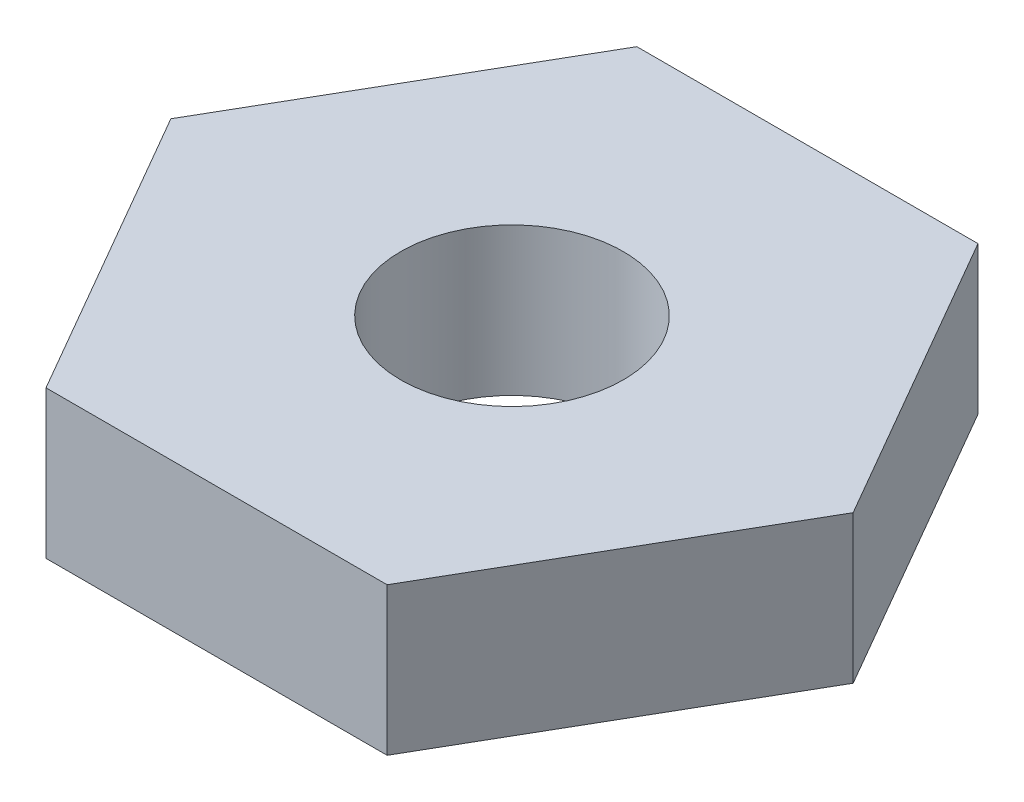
ISO-10303-21;
HEADER;
FILE_DESCRIPTION(('STEP AP214'),'2;1');
FILE_NAME('part.step','',(''),(''),'','','');
FILE_SCHEMA(('AUTOMOTIVE_DESIGN { 1 0 10303 214 1 1 1 1 }'));
ENDSEC;
DATA;
#1=APPLICATION_CONTEXT('core data for automotive mechanical design processes');
#2=APPLICATION_PROTOCOL_DEFINITION('international standard','automotive_design',2000,#1);
#3=PRODUCT_CONTEXT('',#1,'mechanical');
#4=PRODUCT('Part','Part','',(#3));
#5=PRODUCT_RELATED_PRODUCT_CATEGORY('part','',(#4));
#6=PRODUCT_DEFINITION_FORMATION('','',#4);
#7=PRODUCT_DEFINITION_CONTEXT('part definition',#1,'design');
#8=PRODUCT_DEFINITION('design','',#6,#7);
#9=PRODUCT_DEFINITION_SHAPE('','',#8);
#10=(LENGTH_UNIT() NAMED_UNIT(*) SI_UNIT(.MILLI.,.METRE.));
#11=(NAMED_UNIT(*) PLANE_ANGLE_UNIT() SI_UNIT($,.RADIAN.));
#12=(NAMED_UNIT(*) SI_UNIT($,.STERADIAN.) SOLID_ANGLE_UNIT());
#13=UNCERTAINTY_MEASURE_WITH_UNIT(LENGTH_MEASURE(1.E-05),#10,'distance_accuracy_value','');
#14=(GEOMETRIC_REPRESENTATION_CONTEXT(3) GLOBAL_UNCERTAINTY_ASSIGNED_CONTEXT((#13)) GLOBAL_UNIT_ASSIGNED_CONTEXT((#10,
#11,#12)) REPRESENTATION_CONTEXT('',''));
#15=CARTESIAN_POINT('',(0.,0.,0.));
#16=DIRECTION('',(0.,0.,1.));
#17=DIRECTION('',(1.,0.,0.));
#18=AXIS2_PLACEMENT_3D('',#15,#16,#17);
#19=CARTESIAN_POINT('',(0.,1.5,0.));
#20=DIRECTION('',(0.,1.,0.));
#21=DIRECTION('',(0.,0.,1.));
#22=AXIS2_PLACEMENT_3D('',#19,#20,#21);
#23=PLANE('',#22);
#24=DIRECTION('',(0.5,0.,-0.866025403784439));
#25=VECTOR('',#24,1.);
#26=CARTESIAN_POINT('',(1.73205080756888,1.5,3.));
#27=LINE('',#26,#25);
#28=CARTESIAN_POINT('',(1.73205080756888,1.5,3.));
#29=VERTEX_POINT('',#28);
#30=CARTESIAN_POINT('',(3.46410161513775,1.5,0.));
#31=VERTEX_POINT('',#30);
#32=EDGE_CURVE('E146',#29,#31,#27,.T.);
#33=ORIENTED_EDGE('',*,*,#32,.T.);
#34=DIRECTION('',(-0.5,0.,-0.866025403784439));
#35=VECTOR('',#34,1.);
#36=CARTESIAN_POINT('',(3.46410161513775,1.5,0.));
#37=LINE('',#36,#35);
#38=CARTESIAN_POINT('',(1.73205080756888,1.5,-3.));
#39=VERTEX_POINT('',#38);
#40=EDGE_CURVE('E94',#31,#39,#37,.T.);
#41=ORIENTED_EDGE('',*,*,#40,.T.);
#42=DIRECTION('',(-1.,0.,0.));
#43=VECTOR('',#42,1.);
#44=CARTESIAN_POINT('',(1.73205080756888,1.5,-3.));
#45=LINE('',#44,#43);
#46=CARTESIAN_POINT('',(-1.73205080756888,1.5,-3.));
#47=VERTEX_POINT('',#46);
#48=EDGE_CURVE('E107',#39,#47,#45,.T.);
#49=ORIENTED_EDGE('',*,*,#48,.T.);
#50=DIRECTION('',(-0.5,0.,0.866025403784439));
#51=VECTOR('',#50,1.);
#52=CARTESIAN_POINT('',(-1.73205080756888,1.5,-3.));
#53=LINE('',#52,#51);
#54=CARTESIAN_POINT('',(-3.46410161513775,1.5,0.));
#55=VERTEX_POINT('',#54);
#56=EDGE_CURVE('E101',#47,#55,#53,.T.);
#57=ORIENTED_EDGE('',*,*,#56,.T.);
#58=DIRECTION('',(0.5,0.,0.866025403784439));
#59=VECTOR('',#58,1.);
#60=CARTESIAN_POINT('',(-3.46410161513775,1.5,0.));
#61=LINE('',#60,#59);
#62=CARTESIAN_POINT('',(-1.73205080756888,1.5,3.));
#63=VERTEX_POINT('',#62);
#64=EDGE_CURVE('E105',#55,#63,#61,.T.);
#65=ORIENTED_EDGE('',*,*,#64,.T.);
#66=DIRECTION('',(1.,0.,0.));
#67=VECTOR('',#66,1.);
#68=CARTESIAN_POINT('',(-1.73205080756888,1.5,3.));
#69=LINE('',#68,#67);
#70=EDGE_CURVE('E57',#63,#29,#69,.T.);
#71=ORIENTED_EDGE('',*,*,#70,.T.);
#72=EDGE_LOOP('',(#33,#41,#49,#57,#65,#71));
#73=FACE_BOUND('',#72,.T.);
#74=CARTESIAN_POINT('',(0.,1.5,0.));
#75=DIRECTION('',(0.,1.,0.));
#76=DIRECTION('',(0.,0.,1.));
#77=AXIS2_PLACEMENT_3D('',#74,#75,#76);
#78=CIRCLE('',#77,1.13);
#79=CARTESIAN_POINT('',(0.,1.5,1.13));
#80=VERTEX_POINT('',#79);
#81=EDGE_CURVE('E134',#80,#80,#78,.T.);
#82=ORIENTED_EDGE('',*,*,#81,.F.);
#83=EDGE_LOOP('',(#82));
#84=FACE_BOUND('',#83,.T.);
#85=ADVANCED_FACE('F39',(#73,#84),#23,.T.);
#86=CARTESIAN_POINT('',(0.,0.,0.));
#87=DIRECTION('',(0.,1.,0.));
#88=DIRECTION('',(0.,0.,1.));
#89=AXIS2_PLACEMENT_3D('',#86,#87,#88);
#90=PLANE('',#89);
#91=DIRECTION('',(0.5,0.,-0.866025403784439));
#92=VECTOR('',#91,1.);
#93=CARTESIAN_POINT('',(1.73205080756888,0.,3.));
#94=LINE('',#93,#92);
#95=CARTESIAN_POINT('',(1.73205080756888,0.,3.));
#96=VERTEX_POINT('',#95);
#97=CARTESIAN_POINT('',(3.46410161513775,0.,0.));
#98=VERTEX_POINT('',#97);
#99=EDGE_CURVE('E129',#96,#98,#94,.T.);
#100=ORIENTED_EDGE('',*,*,#99,.F.);
#101=DIRECTION('',(1.,0.,0.));
#102=VECTOR('',#101,1.);
#103=CARTESIAN_POINT('',(-1.73205080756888,0.,3.));
#104=LINE('',#103,#102);
#105=CARTESIAN_POINT('',(-1.73205080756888,0.,3.));
#106=VERTEX_POINT('',#105);
#107=EDGE_CURVE('E86',#106,#96,#104,.T.);
#108=ORIENTED_EDGE('',*,*,#107,.F.);
#109=DIRECTION('',(0.5,0.,0.866025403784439));
#110=VECTOR('',#109,1.);
#111=CARTESIAN_POINT('',(-3.46410161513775,0.,0.));
#112=LINE('',#111,#110);
#113=CARTESIAN_POINT('',(-3.46410161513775,0.,0.));
#114=VERTEX_POINT('',#113);
#115=EDGE_CURVE('E80',#114,#106,#112,.T.);
#116=ORIENTED_EDGE('',*,*,#115,.F.);
#117=DIRECTION('',(-0.5,0.,0.866025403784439));
#118=VECTOR('',#117,1.);
#119=CARTESIAN_POINT('',(-1.73205080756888,0.,-3.));
#120=LINE('',#119,#118);
#121=CARTESIAN_POINT('',(-1.73205080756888,0.,-3.));
#122=VERTEX_POINT('',#121);
#123=EDGE_CURVE('E116',#122,#114,#120,.T.);
#124=ORIENTED_EDGE('',*,*,#123,.F.);
#125=DIRECTION('',(-1.,0.,0.));
#126=VECTOR('',#125,1.);
#127=CARTESIAN_POINT('',(1.73205080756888,0.,-3.));
#128=LINE('',#127,#126);
#129=CARTESIAN_POINT('',(1.73205080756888,0.,-3.));
#130=VERTEX_POINT('',#129);
#131=EDGE_CURVE('E137',#130,#122,#128,.T.);
#132=ORIENTED_EDGE('',*,*,#131,.F.);
#133=DIRECTION('',(-0.5,0.,-0.866025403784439));
#134=VECTOR('',#133,1.);
#135=CARTESIAN_POINT('',(3.46410161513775,0.,0.));
#136=LINE('',#135,#134);
#137=EDGE_CURVE('E133',#98,#130,#136,.T.);
#138=ORIENTED_EDGE('',*,*,#137,.F.);
#139=EDGE_LOOP('',(#100,#108,#116,#124,#132,#138));
#140=FACE_BOUND('',#139,.T.);
#141=CARTESIAN_POINT('',(0.,0.,0.));
#142=DIRECTION('',(0.,1.,0.));
#143=DIRECTION('',(0.,0.,1.));
#144=AXIS2_PLACEMENT_3D('',#141,#142,#143);
#145=CIRCLE('',#144,1.13);
#146=CARTESIAN_POINT('',(0.,0.,1.13));
#147=VERTEX_POINT('',#146);
#148=EDGE_CURVE('E243',#147,#147,#145,.T.);
#149=ORIENTED_EDGE('',*,*,#148,.T.);
#150=EDGE_LOOP('',(#149));
#151=FACE_BOUND('',#150,.T.);
#152=ADVANCED_FACE('F159',(#140,#151),#90,.F.);
#153=CARTESIAN_POINT('',(1.73205080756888,1.5,3.));
#154=DIRECTION('',(-0.866025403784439,0.,-0.5));
#155=DIRECTION('',(-0.5,0.,0.866025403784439));
#156=AXIS2_PLACEMENT_3D('',#153,#154,#155);
#157=PLANE('',#156);
#158=ORIENTED_EDGE('',*,*,#99,.T.);
#159=DIRECTION('',(0.,-1.,0.));
#160=VECTOR('',#159,1.);
#161=CARTESIAN_POINT('',(3.46410161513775,1.5,0.));
#162=LINE('',#161,#160);
#163=EDGE_CURVE('E11',#31,#98,#162,.T.);
#164=ORIENTED_EDGE('',*,*,#163,.F.);
#165=ORIENTED_EDGE('',*,*,#32,.F.);
#166=DIRECTION('',(0.,-1.,0.));
#167=VECTOR('',#166,1.);
#168=CARTESIAN_POINT('',(1.73205080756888,1.5,3.));
#169=LINE('',#168,#167);
#170=EDGE_CURVE('E125',#29,#96,#169,.T.);
#171=ORIENTED_EDGE('',*,*,#170,.T.);
#172=EDGE_LOOP('',(#158,#164,#165,#171));
#173=FACE_BOUND('',#172,.T.);
#174=ADVANCED_FACE('F41',(#173),#157,.F.);
#175=CARTESIAN_POINT('',(3.46410161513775,1.5,0.));
#176=DIRECTION('',(-0.866025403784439,0.,0.5));
#177=DIRECTION('',(0.5,0.,0.866025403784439));
#178=AXIS2_PLACEMENT_3D('',#175,#176,#177);
#179=PLANE('',#178);
#180=ORIENTED_EDGE('',*,*,#137,.T.);
#181=DIRECTION('',(0.,-1.,0.));
#182=VECTOR('',#181,1.);
#183=CARTESIAN_POINT('',(1.73205080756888,1.5,-3.));
#184=LINE('',#183,#182);
#185=EDGE_CURVE('E49',#39,#130,#184,.T.);
#186=ORIENTED_EDGE('',*,*,#185,.F.);
#187=ORIENTED_EDGE('',*,*,#40,.F.);
#188=ORIENTED_EDGE('',*,*,#163,.T.);
#189=EDGE_LOOP('',(#180,#186,#187,#188));
#190=FACE_BOUND('',#189,.T.);
#191=ADVANCED_FACE('F184',(#190),#179,.F.);
#192=CARTESIAN_POINT('',(1.73205080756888,1.5,-3.));
#193=DIRECTION('',(0.,0.,1.));
#194=DIRECTION('',(1.,0.,0.));
#195=AXIS2_PLACEMENT_3D('',#192,#193,#194);
#196=PLANE('',#195);
#197=ORIENTED_EDGE('',*,*,#131,.T.);
#198=DIRECTION('',(0.,-1.,0.));
#199=VECTOR('',#198,1.);
#200=CARTESIAN_POINT('',(-1.73205080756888,1.5,-3.));
#201=LINE('',#200,#199);
#202=EDGE_CURVE('E118',#47,#122,#201,.T.);
#203=ORIENTED_EDGE('',*,*,#202,.F.);
#204=ORIENTED_EDGE('',*,*,#48,.F.);
#205=ORIENTED_EDGE('',*,*,#185,.T.);
#206=EDGE_LOOP('',(#197,#203,#204,#205));
#207=FACE_BOUND('',#206,.T.);
#208=ADVANCED_FACE('F156',(#207),#196,.F.);
#209=CARTESIAN_POINT('',(-1.73205080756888,1.5,-3.));
#210=DIRECTION('',(0.866025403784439,0.,0.5));
#211=DIRECTION('',(0.5,0.,-0.866025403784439));
#212=AXIS2_PLACEMENT_3D('',#209,#210,#211);
#213=PLANE('',#212);
#214=ORIENTED_EDGE('',*,*,#123,.T.);
#215=DIRECTION('',(0.,-1.,0.));
#216=VECTOR('',#215,1.);
#217=CARTESIAN_POINT('',(-3.46410161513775,1.5,0.));
#218=LINE('',#217,#216);
#219=EDGE_CURVE('E113',#55,#114,#218,.T.);
#220=ORIENTED_EDGE('',*,*,#219,.F.);
#221=ORIENTED_EDGE('',*,*,#56,.F.);
#222=ORIENTED_EDGE('',*,*,#202,.T.);
#223=EDGE_LOOP('',(#214,#220,#221,#222));
#224=FACE_BOUND('',#223,.T.);
#225=ADVANCED_FACE('F114',(#224),#213,.F.);
#226=CARTESIAN_POINT('',(-3.46410161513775,1.5,0.));
#227=DIRECTION('',(0.866025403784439,0.,-0.5));
#228=DIRECTION('',(-0.5,0.,-0.866025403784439));
#229=AXIS2_PLACEMENT_3D('',#226,#227,#228);
#230=PLANE('',#229);
#231=ORIENTED_EDGE('',*,*,#115,.T.);
#232=DIRECTION('',(0.,-1.,0.));
#233=VECTOR('',#232,1.);
#234=CARTESIAN_POINT('',(-1.73205080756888,1.5,3.));
#235=LINE('',#234,#233);
#236=EDGE_CURVE('E119',#63,#106,#235,.T.);
#237=ORIENTED_EDGE('',*,*,#236,.F.);
#238=ORIENTED_EDGE('',*,*,#64,.F.);
#239=ORIENTED_EDGE('',*,*,#219,.T.);
#240=EDGE_LOOP('',(#231,#237,#238,#239));
#241=FACE_BOUND('',#240,.T.);
#242=ADVANCED_FACE('F121',(#241),#230,.F.);
#243=CARTESIAN_POINT('',(-1.73205080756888,1.5,3.));
#244=DIRECTION('',(0.,0.,-1.));
#245=DIRECTION('',(-1.,0.,0.));
#246=AXIS2_PLACEMENT_3D('',#243,#244,#245);
#247=PLANE('',#246);
#248=ORIENTED_EDGE('',*,*,#107,.T.);
#249=ORIENTED_EDGE('',*,*,#170,.F.);
#250=ORIENTED_EDGE('',*,*,#70,.F.);
#251=ORIENTED_EDGE('',*,*,#236,.T.);
#252=EDGE_LOOP('',(#248,#249,#250,#251));
#253=FACE_BOUND('',#252,.T.);
#254=ADVANCED_FACE('F164',(#253),#247,.F.);
#255=CARTESIAN_POINT('',(0.,1.5,0.));
#256=DIRECTION('',(0.,-1.,0.));
#257=DIRECTION('',(0.,0.,-1.));
#258=AXIS2_PLACEMENT_3D('',#255,#256,#257);
#259=CYLINDRICAL_SURFACE('',#258,1.13);
#260=ORIENTED_EDGE('',*,*,#81,.T.);
#261=EDGE_LOOP('',(#260));
#262=FACE_BOUND('',#261,.T.);
#263=ORIENTED_EDGE('',*,*,#148,.F.);
#264=EDGE_LOOP('',(#263));
#265=FACE_BOUND('',#264,.T.);
#266=ADVANCED_FACE('F166',(#262,#265),#259,.F.);
#267=CLOSED_SHELL('',(#85,#152,#174,#191,#208,#225,#242,#254,#266));
#268=MANIFOLD_SOLID_BREP('B2',#267);
#269=ADVANCED_BREP_SHAPE_REPRESENTATION('',(#18,#268),#14);
#270=SHAPE_DEFINITION_REPRESENTATION(#9,#269);
ENDSEC;
END-ISO-10303-21;
